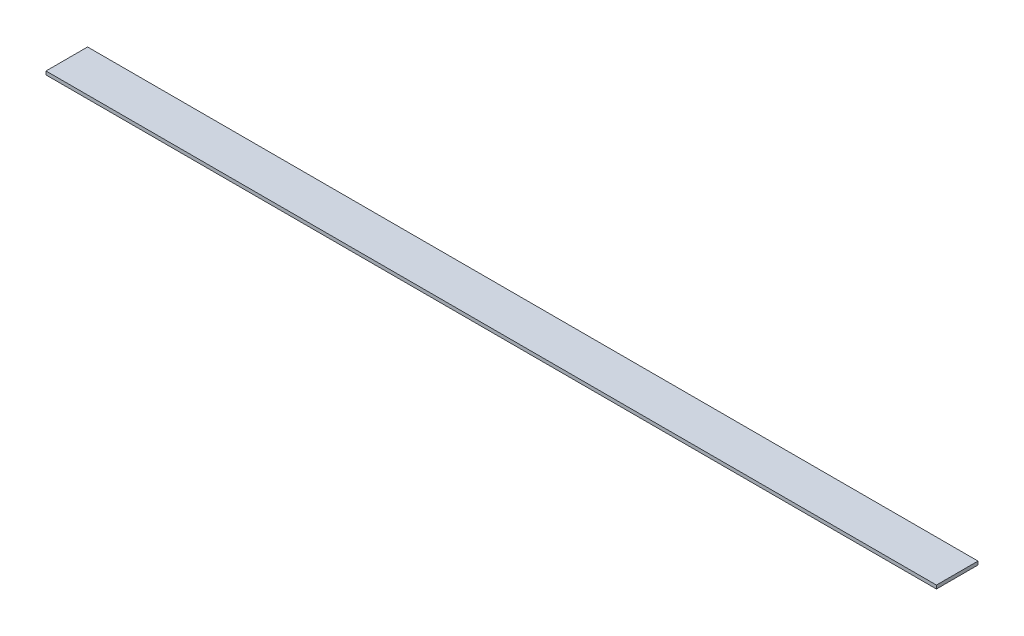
ISO-10303-21;
HEADER;
FILE_DESCRIPTION(('STEP AP214'),'2;1');
FILE_NAME('part.step','',(''),(''),'','','');
FILE_SCHEMA(('AUTOMOTIVE_DESIGN { 1 0 10303 214 1 1 1 1 }'));
ENDSEC;
DATA;
#1=APPLICATION_CONTEXT('core data for automotive mechanical design processes');
#2=APPLICATION_PROTOCOL_DEFINITION('international standard','automotive_design',2000,#1);
#3=PRODUCT_CONTEXT('',#1,'mechanical');
#4=PRODUCT('Part','Part','',(#3));
#5=PRODUCT_RELATED_PRODUCT_CATEGORY('part','',(#4));
#6=PRODUCT_DEFINITION_FORMATION('','',#4);
#7=PRODUCT_DEFINITION_CONTEXT('part definition',#1,'design');
#8=PRODUCT_DEFINITION('design','',#6,#7);
#9=PRODUCT_DEFINITION_SHAPE('','',#8);
#10=(LENGTH_UNIT() NAMED_UNIT(*) SI_UNIT(.MILLI.,.METRE.));
#11=(NAMED_UNIT(*) PLANE_ANGLE_UNIT() SI_UNIT($,.RADIAN.));
#12=(NAMED_UNIT(*) SI_UNIT($,.STERADIAN.) SOLID_ANGLE_UNIT());
#13=UNCERTAINTY_MEASURE_WITH_UNIT(LENGTH_MEASURE(1.E-05),#10,'distance_accuracy_value','');
#14=(GEOMETRIC_REPRESENTATION_CONTEXT(3) GLOBAL_UNCERTAINTY_ASSIGNED_CONTEXT((#13)) GLOBAL_UNIT_ASSIGNED_CONTEXT((#10,
#11,#12)) REPRESENTATION_CONTEXT('',''));
#15=CARTESIAN_POINT('',(0.,0.,0.));
#16=DIRECTION('',(0.,0.,1.));
#17=DIRECTION('',(1.,0.,0.));
#18=AXIS2_PLACEMENT_3D('',#15,#16,#17);
#19=CARTESIAN_POINT('',(815.975,6.35,-38.1));
#20=DIRECTION('',(-1.,0.,0.));
#21=DIRECTION('',(0.,0.,1.));
#22=AXIS2_PLACEMENT_3D('',#19,#20,#21);
#23=PLANE('',#22);
#24=DIRECTION('',(0.,0.,-1.));
#25=VECTOR('',#24,1.);
#26=CARTESIAN_POINT('',(815.975,0.,-38.1));
#27=LINE('',#26,#25);
#28=CARTESIAN_POINT('',(815.975,0.,38.1));
#29=VERTEX_POINT('',#28);
#30=CARTESIAN_POINT('',(815.975,0.,-38.1));
#31=VERTEX_POINT('',#30);
#32=EDGE_CURVE('E97',#29,#31,#27,.T.);
#33=ORIENTED_EDGE('',*,*,#32,.T.);
#34=DIRECTION('',(0.,-1.,0.));
#35=VECTOR('',#34,1.);
#36=CARTESIAN_POINT('',(815.975,6.35,-38.1));
#37=LINE('',#36,#35);
#38=CARTESIAN_POINT('',(815.975,6.35,-38.1));
#39=VERTEX_POINT('',#38);
#40=EDGE_CURVE('E11',#39,#31,#37,.T.);
#41=ORIENTED_EDGE('',*,*,#40,.F.);
#42=DIRECTION('',(0.,0.,-1.));
#43=VECTOR('',#42,1.);
#44=CARTESIAN_POINT('',(815.975,6.35,-38.1));
#45=LINE('',#44,#43);
#46=CARTESIAN_POINT('',(815.975,6.35,38.1));
#47=VERTEX_POINT('',#46);
#48=EDGE_CURVE('E85',#47,#39,#45,.T.);
#49=ORIENTED_EDGE('',*,*,#48,.F.);
#50=DIRECTION('',(0.,-1.,0.));
#51=VECTOR('',#50,1.);
#52=CARTESIAN_POINT('',(815.975,6.35,38.1));
#53=LINE('',#52,#51);
#54=EDGE_CURVE('E93',#47,#29,#53,.T.);
#55=ORIENTED_EDGE('',*,*,#54,.T.);
#56=EDGE_LOOP('',(#33,#41,#49,#55));
#57=FACE_BOUND('',#56,.T.);
#58=ADVANCED_FACE('F34',(#57),#23,.F.);
#59=CARTESIAN_POINT('',(-815.975,6.35,-38.1));
#60=DIRECTION('',(0.,0.,1.));
#61=DIRECTION('',(1.,0.,0.));
#62=AXIS2_PLACEMENT_3D('',#59,#60,#61);
#63=PLANE('',#62);
#64=DIRECTION('',(-1.,0.,0.));
#65=VECTOR('',#64,1.);
#66=CARTESIAN_POINT('',(-815.975,0.,-38.1));
#67=LINE('',#66,#65);
#68=CARTESIAN_POINT('',(-815.975,0.,-38.1));
#69=VERTEX_POINT('',#68);
#70=EDGE_CURVE('E89',#31,#69,#67,.T.);
#71=ORIENTED_EDGE('',*,*,#70,.T.);
#72=DIRECTION('',(0.,-1.,0.));
#73=VECTOR('',#72,1.);
#74=CARTESIAN_POINT('',(-815.975,6.35,-38.1));
#75=LINE('',#74,#73);
#76=CARTESIAN_POINT('',(-815.975,6.35,-38.1));
#77=VERTEX_POINT('',#76);
#78=EDGE_CURVE('E42',#77,#69,#75,.T.);
#79=ORIENTED_EDGE('',*,*,#78,.F.);
#80=DIRECTION('',(-1.,0.,0.));
#81=VECTOR('',#80,1.);
#82=CARTESIAN_POINT('',(-815.975,6.35,-38.1));
#83=LINE('',#82,#81);
#84=EDGE_CURVE('E80',#39,#77,#83,.T.);
#85=ORIENTED_EDGE('',*,*,#84,.F.);
#86=ORIENTED_EDGE('',*,*,#40,.T.);
#87=EDGE_LOOP('',(#71,#79,#85,#86));
#88=FACE_BOUND('',#87,.T.);
#89=ADVANCED_FACE('F88',(#88),#63,.F.);
#90=CARTESIAN_POINT('',(-815.975,6.35,-38.1));
#91=DIRECTION('',(1.,0.,0.));
#92=DIRECTION('',(0.,0.,-1.));
#93=AXIS2_PLACEMENT_3D('',#90,#91,#92);
#94=PLANE('',#93);
#95=DIRECTION('',(0.,0.,1.));
#96=VECTOR('',#95,1.);
#97=CARTESIAN_POINT('',(-815.975,0.,-38.1));
#98=LINE('',#97,#96);
#99=CARTESIAN_POINT('',(-815.975,0.,38.1));
#100=VERTEX_POINT('',#99);
#101=EDGE_CURVE('E67',#69,#100,#98,.T.);
#102=ORIENTED_EDGE('',*,*,#101,.T.);
#103=DIRECTION('',(0.,-1.,0.));
#104=VECTOR('',#103,1.);
#105=CARTESIAN_POINT('',(-815.975,6.35,38.1));
#106=LINE('',#105,#104);
#107=CARTESIAN_POINT('',(-815.975,6.35,38.1));
#108=VERTEX_POINT('',#107);
#109=EDGE_CURVE('E90',#108,#100,#106,.T.);
#110=ORIENTED_EDGE('',*,*,#109,.F.);
#111=DIRECTION('',(0.,0.,1.));
#112=VECTOR('',#111,1.);
#113=CARTESIAN_POINT('',(-815.975,6.35,-38.1));
#114=LINE('',#113,#112);
#115=EDGE_CURVE('E83',#77,#108,#114,.T.);
#116=ORIENTED_EDGE('',*,*,#115,.F.);
#117=ORIENTED_EDGE('',*,*,#78,.T.);
#118=EDGE_LOOP('',(#102,#110,#116,#117));
#119=FACE_BOUND('',#118,.T.);
#120=ADVANCED_FACE('F91',(#119),#94,.F.);
#121=CARTESIAN_POINT('',(-815.975,6.35,38.1));
#122=DIRECTION('',(0.,0.,-1.));
#123=DIRECTION('',(-1.,0.,0.));
#124=AXIS2_PLACEMENT_3D('',#121,#122,#123);
#125=PLANE('',#124);
#126=DIRECTION('',(1.,0.,0.));
#127=VECTOR('',#126,1.);
#128=CARTESIAN_POINT('',(-815.975,0.,38.1));
#129=LINE('',#128,#127);
#130=EDGE_CURVE('E73',#100,#29,#129,.T.);
#131=ORIENTED_EDGE('',*,*,#130,.T.);
#132=ORIENTED_EDGE('',*,*,#54,.F.);
#133=DIRECTION('',(1.,0.,0.));
#134=VECTOR('',#133,1.);
#135=CARTESIAN_POINT('',(-815.975,6.35,38.1));
#136=LINE('',#135,#134);
#137=EDGE_CURVE('E50',#108,#47,#136,.T.);
#138=ORIENTED_EDGE('',*,*,#137,.F.);
#139=ORIENTED_EDGE('',*,*,#109,.T.);
#140=EDGE_LOOP('',(#131,#132,#138,#139));
#141=FACE_BOUND('',#140,.T.);
#142=ADVANCED_FACE('F104',(#141),#125,.F.);
#143=CARTESIAN_POINT('',(815.974999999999,6.35,38.1));
#144=DIRECTION('',(0.,1.,0.));
#145=DIRECTION('',(0.,0.,1.));
#146=AXIS2_PLACEMENT_3D('',#143,#144,#145);
#147=PLANE('',#146);
#148=ORIENTED_EDGE('',*,*,#48,.T.);
#149=ORIENTED_EDGE('',*,*,#84,.T.);
#150=ORIENTED_EDGE('',*,*,#115,.T.);
#151=ORIENTED_EDGE('',*,*,#137,.T.);
#152=EDGE_LOOP('',(#148,#149,#150,#151));
#153=FACE_BOUND('',#152,.T.);
#154=ADVANCED_FACE('F81',(#153),#147,.T.);
#155=CARTESIAN_POINT('',(815.974999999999,0.,38.1));
#156=DIRECTION('',(0.,1.,0.));
#157=DIRECTION('',(0.,0.,1.));
#158=AXIS2_PLACEMENT_3D('',#155,#156,#157);
#159=PLANE('',#158);
#160=ORIENTED_EDGE('',*,*,#32,.F.);
#161=ORIENTED_EDGE('',*,*,#130,.F.);
#162=ORIENTED_EDGE('',*,*,#101,.F.);
#163=ORIENTED_EDGE('',*,*,#70,.F.);
#164=EDGE_LOOP('',(#160,#161,#162,#163));
#165=FACE_BOUND('',#164,.T.);
#166=ADVANCED_FACE('F107',(#165),#159,.F.);
#167=CLOSED_SHELL('',(#58,#89,#120,#142,#154,#166));
#168=MANIFOLD_SOLID_BREP('B2',#167);
#169=ADVANCED_BREP_SHAPE_REPRESENTATION('',(#18,#168),#14);
#170=SHAPE_DEFINITION_REPRESENTATION(#9,#169);
ENDSEC;
END-ISO-10303-21;
